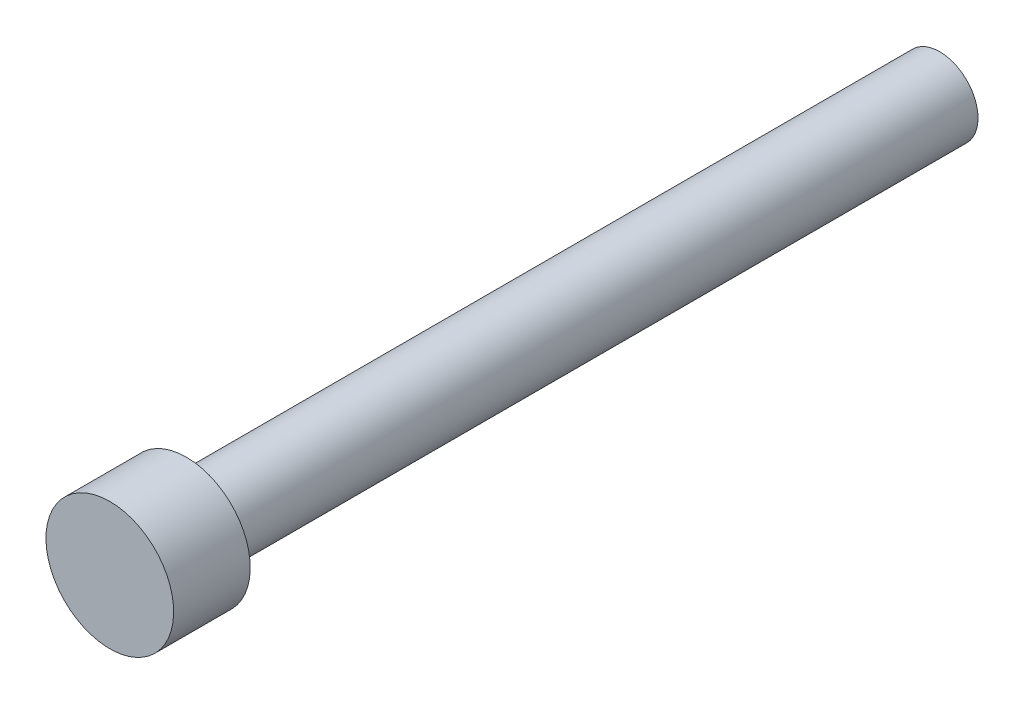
from build123d import *


with BuildPart() as part:
    # Esquisse1 → R_volution1 (revolve)
    with BuildSketch(Plane(origin=(0, 0, 0), x_dir=(0, 0, -1), z_dir=(1, 0, 0))):
        Polygon((0, 0), (6, 0), (6, -2), (65, -2), (65, -5), (0, -5), align=None)
    revolve(axis=Axis((0, -5, -65), (0, 0, 1)))


solid = part.part
